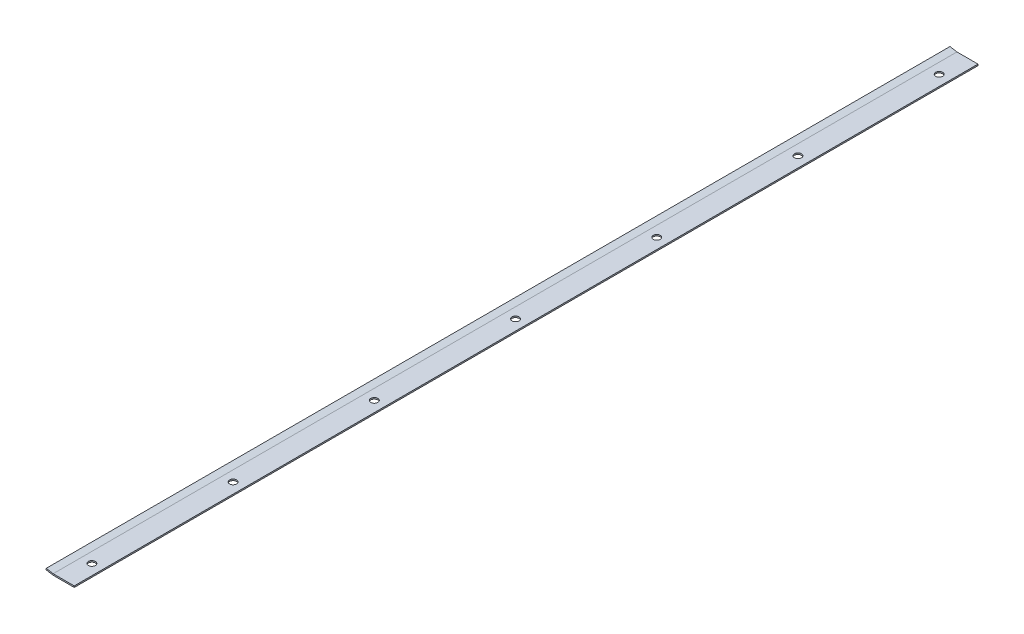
from build123d import *

# Parameters (mm, degrees)
EXTRU_MINCE1_DEPTH         = 320
ENL_V_MAT_EXTRU_2_REACH    = 322.626
ESQUISSE2_R                = 2.5
R_P_TITION_LIN_AIRE1_COUNT = 7
R_P_TITION_LIN_AIRE1_PITCH = 100


with BuildPart() as part:
    # Esquisse1 → Extru.-Mince1 (new, symmetric)
    with BuildSketch(Plane(origin=(0, 0, 0), x_dir=(-1, 0, 0), z_dir=(0, 0, 1))):
        Polygon((0, 0), (15, 0), (20, -0.881634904), (19.826351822, -1.866442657), (14.912511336, -1), (0, -1), align=None)
    extrude(amount=EXTRU_MINCE1_DEPTH, both=True)

    # Esquisse2 → Enl_v. mat.-Extru.2 (cut, up to next)
    with BuildSketch(Plane(origin=(0, 1, 0), x_dir=(-1, 0, 0), z_dir=(0, -1, 0)), mode=Mode.PRIVATE) as enl_v_mat_extru_2_sk1:
        with Locations(Location((7.5, -300, 0), (0, 0, 90))):
            Circle(ESQUISSE2_R)
    enl_v_mat_extru_2_tool1 = extrude(enl_v_mat_extru_2_sk1.sketch, amount=ENL_V_MAT_EXTRU_2_REACH, mode=Mode.PRIVATE) & part.part
    enl_v_mat_extru_2 = enl_v_mat_extru_2_tool1.solids().sort_by_distance((-7.5, 1, 300))[0]
    add(enl_v_mat_extru_2, mode=Mode.SUBTRACT)

    # R_p_tition lin_aire1: Enl_v. mat.-Extru.2 ×7
    with Locations(*[(0, 0, -i * R_P_TITION_LIN_AIRE1_PITCH) for i in range(1, R_P_TITION_LIN_AIRE1_COUNT)]):
        add(enl_v_mat_extru_2, mode=Mode.SUBTRACT)


solid = part.part
